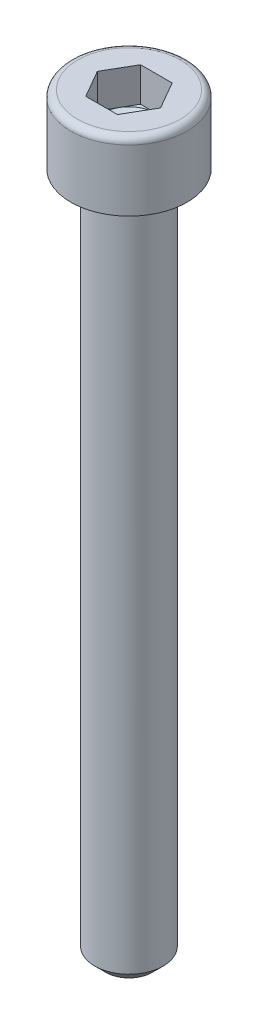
ISO-10303-21;
HEADER;
FILE_DESCRIPTION(('STEP AP214'),'2;1');
FILE_NAME('part.step','',(''),(''),'','','');
FILE_SCHEMA(('AUTOMOTIVE_DESIGN { 1 0 10303 214 1 1 1 1 }'));
ENDSEC;
DATA;
#1=APPLICATION_CONTEXT('core data for automotive mechanical design processes');
#2=APPLICATION_PROTOCOL_DEFINITION('international standard','automotive_design',2000,#1);
#3=PRODUCT_CONTEXT('',#1,'mechanical');
#4=PRODUCT('Part','Part','',(#3));
#5=PRODUCT_RELATED_PRODUCT_CATEGORY('part','',(#4));
#6=PRODUCT_DEFINITION_FORMATION('','',#4);
#7=PRODUCT_DEFINITION_CONTEXT('part definition',#1,'design');
#8=PRODUCT_DEFINITION('design','',#6,#7);
#9=PRODUCT_DEFINITION_SHAPE('','',#8);
#10=(LENGTH_UNIT() NAMED_UNIT(*) SI_UNIT(.MILLI.,.METRE.));
#11=(NAMED_UNIT(*) PLANE_ANGLE_UNIT() SI_UNIT($,.RADIAN.));
#12=(NAMED_UNIT(*) SI_UNIT($,.STERADIAN.) SOLID_ANGLE_UNIT());
#13=UNCERTAINTY_MEASURE_WITH_UNIT(LENGTH_MEASURE(1.E-05),#10,'distance_accuracy_value','');
#14=(GEOMETRIC_REPRESENTATION_CONTEXT(3) GLOBAL_UNCERTAINTY_ASSIGNED_CONTEXT((#13)) GLOBAL_UNIT_ASSIGNED_CONTEXT((#10,
#11,#12)) REPRESENTATION_CONTEXT('',''));
#15=CARTESIAN_POINT('',(0.,0.,0.));
#16=DIRECTION('',(0.,0.,1.));
#17=DIRECTION('',(1.,0.,0.));
#18=AXIS2_PLACEMENT_3D('',#15,#16,#17);
#19=CARTESIAN_POINT('',(-3.46410161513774,2.5,2.));
#20=DIRECTION('',(0.,-1.,0.));
#21=DIRECTION('',(0.,0.,-1.));
#22=AXIS2_PLACEMENT_3D('',#19,#20,#21);
#23=PLANE('',#22);
#24=DIRECTION('',(-0.499999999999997,0.,0.86602540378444));
#25=VECTOR('',#24,1.);
#26=CARTESIAN_POINT('',(1.73205080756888,2.5,0.999999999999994));
#27=LINE('',#26,#25);
#28=CARTESIAN_POINT('',(1.73205080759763,2.49999999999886,1.00000000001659));
#29=VERTEX_POINT('',#28);
#30=CARTESIAN_POINT('',(1.15470053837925,2.5,2.));
#31=VERTEX_POINT('',#30);
#32=EDGE_CURVE('E102',#29,#31,#27,.T.);
#33=ORIENTED_EDGE('',*,*,#32,.F.);
#34=CARTESIAN_POINT('',(0.,2.49999999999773,0.));
#35=DIRECTION('',(0.,1.,0.));
#36=DIRECTION('',(-1.,0.,0.));
#37=AXIS2_PLACEMENT_3D('',#34,#35,#36);
#38=CIRCLE('',#37,2.00000000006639);
#39=CARTESIAN_POINT('',(0.,2.49999999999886,2.0000000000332));
#40=VERTEX_POINT('',#39);
#41=EDGE_CURVE('E110',#29,#40,#38,.F.);
#42=ORIENTED_EDGE('',*,*,#41,.T.);
#43=DIRECTION('',(1.,0.,0.));
#44=VECTOR('',#43,1.);
#45=CARTESIAN_POINT('',(-3.46410161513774,2.5,2.));
#46=LINE('',#45,#44);
#47=EDGE_CURVE('E79',#31,#40,#46,.F.);
#48=ORIENTED_EDGE('',*,*,#47,.F.);
#49=EDGE_LOOP('',(#33,#42,#48));
#50=FACE_BOUND('',#49,.T.);
#51=ADVANCED_FACE('F16',(#50),#23,.F.);
#52=CARTESIAN_POINT('',(-3.46410161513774,2.5,2.));
#53=DIRECTION('',(0.,-1.,0.));
#54=DIRECTION('',(0.,0.,-1.));
#55=AXIS2_PLACEMENT_3D('',#52,#53,#54);
#56=PLANE('',#55);
#57=DIRECTION('',(1.,0.,0.));
#58=VECTOR('',#57,1.);
#59=CARTESIAN_POINT('',(-3.46410161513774,2.5,2.));
#60=LINE('',#59,#58);
#61=CARTESIAN_POINT('',(-1.15470053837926,2.5,2.));
#62=VERTEX_POINT('',#61);
#63=EDGE_CURVE('E261',#40,#62,#60,.F.);
#64=ORIENTED_EDGE('',*,*,#63,.F.);
#65=CARTESIAN_POINT('',(0.,2.49999999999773,0.));
#66=DIRECTION('',(0.,1.,0.));
#67=DIRECTION('',(-1.,0.,0.));
#68=AXIS2_PLACEMENT_3D('',#65,#66,#67);
#69=CIRCLE('',#68,2.00000000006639);
#70=CARTESIAN_POINT('',(-1.73205080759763,2.49999999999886,1.00000000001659));
#71=VERTEX_POINT('',#70);
#72=EDGE_CURVE('E116',#40,#71,#69,.F.);
#73=ORIENTED_EDGE('',*,*,#72,.T.);
#74=DIRECTION('',(-0.499999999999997,0.,-0.86602540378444));
#75=VECTOR('',#74,1.);
#76=CARTESIAN_POINT('',(-1.15470053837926,2.5,2.));
#77=LINE('',#76,#75);
#78=EDGE_CURVE('E259',#62,#71,#77,.T.);
#79=ORIENTED_EDGE('',*,*,#78,.F.);
#80=EDGE_LOOP('',(#64,#73,#79));
#81=FACE_BOUND('',#80,.T.);
#82=ADVANCED_FACE('F263',(#81),#56,.F.);
#83=CARTESIAN_POINT('',(-3.46410161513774,2.5,2.));
#84=DIRECTION('',(0.,-1.,0.));
#85=DIRECTION('',(0.,0.,-1.));
#86=AXIS2_PLACEMENT_3D('',#83,#84,#85);
#87=PLANE('',#86);
#88=DIRECTION('',(1.,0.,0.));
#89=VECTOR('',#88,1.);
#90=CARTESIAN_POINT('',(-3.46410161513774,2.5,-2.));
#91=LINE('',#90,#89);
#92=CARTESIAN_POINT('',(0.,2.49999999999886,-2.0000000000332));
#93=VERTEX_POINT('',#92);
#94=CARTESIAN_POINT('',(1.15470053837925,2.5,-2.));
#95=VERTEX_POINT('',#94);
#96=EDGE_CURVE('E121',#93,#95,#91,.T.);
#97=ORIENTED_EDGE('',*,*,#96,.F.);
#98=CARTESIAN_POINT('',(0.,2.49999999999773,0.));
#99=DIRECTION('',(0.,1.,0.));
#100=DIRECTION('',(-1.,0.,0.));
#101=AXIS2_PLACEMENT_3D('',#98,#99,#100);
#102=CIRCLE('',#101,2.00000000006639);
#103=CARTESIAN_POINT('',(1.73205080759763,2.49999999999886,-1.00000000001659));
#104=VERTEX_POINT('',#103);
#105=EDGE_CURVE('E96',#93,#104,#102,.F.);
#106=ORIENTED_EDGE('',*,*,#105,.T.);
#107=DIRECTION('',(0.499999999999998,0.,0.86602540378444));
#108=VECTOR('',#107,1.);
#109=CARTESIAN_POINT('',(1.15470053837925,2.5,-2.));
#110=LINE('',#109,#108);
#111=EDGE_CURVE('E117',#95,#104,#110,.T.);
#112=ORIENTED_EDGE('',*,*,#111,.F.);
#113=EDGE_LOOP('',(#97,#106,#112));
#114=FACE_BOUND('',#113,.T.);
#115=ADVANCED_FACE('F285',(#114),#87,.F.);
#116=CARTESIAN_POINT('',(0.,2.49999999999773,0.));
#117=DIRECTION('',(0.,1.,0.));
#118=DIRECTION('',(-1.,0.,0.));
#119=AXIS2_PLACEMENT_3D('',#116,#117,#118);
#120=CONICAL_SURFACE('',#119,2.00000000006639,1.04719755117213);
#121=CARTESIAN_POINT('',(-7.105427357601E-11,1.34529946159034,0.));
#122=VERTEX_POINT('',#121);
#123=VERTEX_LOOP('',#122);
#124=FACE_BOUND('',#123,.T.);
#125=ORIENTED_EDGE('',*,*,#41,.F.);
#126=CARTESIAN_POINT('',(0.,2.49999999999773,0.));
#127=DIRECTION('',(0.,1.,0.));
#128=DIRECTION('',(-1.,0.,0.));
#129=AXIS2_PLACEMENT_3D('',#126,#127,#128);
#130=CIRCLE('',#129,2.00000000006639);
#131=EDGE_CURVE('E85',#104,#29,#130,.F.);
#132=ORIENTED_EDGE('',*,*,#131,.F.);
#133=ORIENTED_EDGE('',*,*,#105,.F.);
#134=CARTESIAN_POINT('',(0.,2.49999999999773,0.));
#135=DIRECTION('',(0.,1.,0.));
#136=DIRECTION('',(-1.,0.,0.));
#137=AXIS2_PLACEMENT_3D('',#134,#135,#136);
#138=CIRCLE('',#137,2.00000000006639);
#139=CARTESIAN_POINT('',(-1.73205080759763,2.49999999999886,-1.00000000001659));
#140=VERTEX_POINT('',#139);
#141=EDGE_CURVE('E95',#93,#140,#138,.T.);
#142=ORIENTED_EDGE('',*,*,#141,.T.);
#143=CARTESIAN_POINT('',(0.,2.49999999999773,0.));
#144=DIRECTION('',(0.,1.,0.));
#145=DIRECTION('',(-1.,0.,0.));
#146=AXIS2_PLACEMENT_3D('',#143,#144,#145);
#147=CIRCLE('',#146,2.00000000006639);
#148=EDGE_CURVE('E119',#71,#140,#147,.F.);
#149=ORIENTED_EDGE('',*,*,#148,.F.);
#150=ORIENTED_EDGE('',*,*,#72,.F.);
#151=EDGE_LOOP('',(#125,#132,#133,#142,#149,#150));
#152=FACE_BOUND('',#151,.T.);
#153=ADVANCED_FACE('F114',(#124,#152),#120,.F.);
#154=CARTESIAN_POINT('',(-3.46410161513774,2.5,2.));
#155=DIRECTION('',(0.,-1.,0.));
#156=DIRECTION('',(0.,0.,-1.));
#157=AXIS2_PLACEMENT_3D('',#154,#155,#156);
#158=PLANE('',#157);
#159=DIRECTION('',(0.499999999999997,0.,-0.86602540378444));
#160=VECTOR('',#159,1.);
#161=CARTESIAN_POINT('',(-1.15470053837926,2.5,-2.));
#162=LINE('',#161,#160);
#163=CARTESIAN_POINT('',(-1.15470053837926,2.5,-2.));
#164=VERTEX_POINT('',#163);
#165=EDGE_CURVE('E203',#140,#164,#162,.T.);
#166=ORIENTED_EDGE('',*,*,#165,.F.);
#167=ORIENTED_EDGE('',*,*,#141,.F.);
#168=DIRECTION('',(1.,0.,0.));
#169=VECTOR('',#168,1.);
#170=CARTESIAN_POINT('',(1.15470053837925,2.5,-2.));
#171=LINE('',#170,#169);
#172=EDGE_CURVE('E204',#164,#93,#171,.T.);
#173=ORIENTED_EDGE('',*,*,#172,.F.);
#174=EDGE_LOOP('',(#166,#167,#173));
#175=FACE_BOUND('',#174,.T.);
#176=ADVANCED_FACE('F245',(#175),#158,.F.);
#177=CARTESIAN_POINT('',(-3.46410161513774,2.5,2.));
#178=DIRECTION('',(0.,-1.,0.));
#179=DIRECTION('',(0.,0.,-1.));
#180=AXIS2_PLACEMENT_3D('',#177,#178,#179);
#181=PLANE('',#180);
#182=DIRECTION('',(-0.499999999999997,0.,-0.86602540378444));
#183=VECTOR('',#182,1.);
#184=CARTESIAN_POINT('',(-1.15470053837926,2.5,2.));
#185=LINE('',#184,#183);
#186=CARTESIAN_POINT('',(-2.3094010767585,2.5,0.));
#187=VERTEX_POINT('',#186);
#188=EDGE_CURVE('E189',#71,#187,#185,.T.);
#189=ORIENTED_EDGE('',*,*,#188,.F.);
#190=ORIENTED_EDGE('',*,*,#148,.T.);
#191=DIRECTION('',(0.499999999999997,0.,-0.86602540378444));
#192=VECTOR('',#191,1.);
#193=CARTESIAN_POINT('',(-1.15470053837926,2.5,-2.));
#194=LINE('',#193,#192);
#195=EDGE_CURVE('E200',#187,#140,#194,.T.);
#196=ORIENTED_EDGE('',*,*,#195,.F.);
#197=EDGE_LOOP('',(#189,#190,#196));
#198=FACE_BOUND('',#197,.T.);
#199=ADVANCED_FACE('F239',(#198),#181,.F.);
#200=CARTESIAN_POINT('',(-3.46410161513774,2.5,2.));
#201=DIRECTION('',(0.,-1.,0.));
#202=DIRECTION('',(0.,0.,-1.));
#203=AXIS2_PLACEMENT_3D('',#200,#201,#202);
#204=PLANE('',#203);
#205=DIRECTION('',(0.499999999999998,0.,0.86602540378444));
#206=VECTOR('',#205,1.);
#207=CARTESIAN_POINT('',(1.15470053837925,2.5,-2.));
#208=LINE('',#207,#206);
#209=CARTESIAN_POINT('',(2.3094010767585,2.5,0.));
#210=VERTEX_POINT('',#209);
#211=EDGE_CURVE('E91',#104,#210,#208,.T.);
#212=ORIENTED_EDGE('',*,*,#211,.F.);
#213=ORIENTED_EDGE('',*,*,#131,.T.);
#214=DIRECTION('',(-0.499999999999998,0.,0.86602540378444));
#215=VECTOR('',#214,1.);
#216=CARTESIAN_POINT('',(1.15470053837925,2.5,2.));
#217=LINE('',#216,#215);
#218=EDGE_CURVE('E88',#210,#29,#217,.T.);
#219=ORIENTED_EDGE('',*,*,#218,.F.);
#220=EDGE_LOOP('',(#212,#213,#219));
#221=FACE_BOUND('',#220,.T.);
#222=ADVANCED_FACE('F87',(#221),#204,.F.);
#223=CARTESIAN_POINT('',(1.15470053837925,2.5,-2.));
#224=DIRECTION('',(0.,0.,1.));
#225=DIRECTION('',(1.,0.,0.));
#226=AXIS2_PLACEMENT_3D('',#223,#224,#225);
#227=PLANE('',#226);
#228=ORIENTED_EDGE('',*,*,#96,.T.);
#229=DIRECTION('',(0.,1.,0.));
#230=VECTOR('',#229,1.);
#231=CARTESIAN_POINT('',(1.15470053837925,2.5,-2.));
#232=LINE('',#231,#230);
#233=CARTESIAN_POINT('',(1.15470053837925,5.,-2.));
#234=VERTEX_POINT('',#233);
#235=EDGE_CURVE('E181',#234,#95,#232,.F.);
#236=ORIENTED_EDGE('',*,*,#235,.F.);
#237=DIRECTION('',(1.,0.,0.));
#238=VECTOR('',#237,1.);
#239=CARTESIAN_POINT('',(2.,5.,-2.));
#240=LINE('',#239,#238);
#241=CARTESIAN_POINT('',(-1.15470053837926,5.,-2.));
#242=VERTEX_POINT('',#241);
#243=EDGE_CURVE('E165',#234,#242,#240,.F.);
#244=ORIENTED_EDGE('',*,*,#243,.T.);
#245=DIRECTION('',(0.,1.,0.));
#246=VECTOR('',#245,1.);
#247=CARTESIAN_POINT('',(-1.15470053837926,2.5,-2.));
#248=LINE('',#247,#246);
#249=EDGE_CURVE('E193',#164,#242,#248,.T.);
#250=ORIENTED_EDGE('',*,*,#249,.F.);
#251=ORIENTED_EDGE('',*,*,#172,.T.);
#252=EDGE_LOOP('',(#228,#236,#244,#250,#251));
#253=FACE_BOUND('',#252,.T.);
#254=ADVANCED_FACE('F277',(#253),#227,.T.);
#255=CARTESIAN_POINT('',(-1.15470053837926,2.5,-2.));
#256=DIRECTION('',(0.86602540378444,0.,0.499999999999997));
#257=DIRECTION('',(0.499999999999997,0.,-0.86602540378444));
#258=AXIS2_PLACEMENT_3D('',#255,#256,#257);
#259=PLANE('',#258);
#260=ORIENTED_EDGE('',*,*,#165,.T.);
#261=ORIENTED_EDGE('',*,*,#249,.T.);
#262=DIRECTION('',(-0.499999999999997,0.,0.86602540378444));
#263=VECTOR('',#262,1.);
#264=CARTESIAN_POINT('',(-1.15470053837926,5.,-2.));
#265=LINE('',#264,#263);
#266=CARTESIAN_POINT('',(-2.3094010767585,5.,0.));
#267=VERTEX_POINT('',#266);
#268=EDGE_CURVE('E252',#242,#267,#265,.T.);
#269=ORIENTED_EDGE('',*,*,#268,.T.);
#270=DIRECTION('',(0.,1.,0.));
#271=VECTOR('',#270,1.);
#272=CARTESIAN_POINT('',(-2.3094010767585,2.5,0.));
#273=LINE('',#272,#271);
#274=EDGE_CURVE('E192',#187,#267,#273,.T.);
#275=ORIENTED_EDGE('',*,*,#274,.F.);
#276=ORIENTED_EDGE('',*,*,#195,.T.);
#277=EDGE_LOOP('',(#260,#261,#269,#275,#276));
#278=FACE_BOUND('',#277,.T.);
#279=ADVANCED_FACE('F248',(#278),#259,.T.);
#280=CARTESIAN_POINT('',(-1.15470053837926,2.5,2.));
#281=DIRECTION('',(0.86602540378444,0.,-0.499999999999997));
#282=DIRECTION('',(-0.499999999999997,0.,-0.86602540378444));
#283=AXIS2_PLACEMENT_3D('',#280,#281,#282);
#284=PLANE('',#283);
#285=ORIENTED_EDGE('',*,*,#188,.T.);
#286=ORIENTED_EDGE('',*,*,#274,.T.);
#287=DIRECTION('',(0.499999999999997,0.,0.86602540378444));
#288=VECTOR('',#287,1.);
#289=CARTESIAN_POINT('',(-2.3094010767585,5.,0.));
#290=LINE('',#289,#288);
#291=CARTESIAN_POINT('',(-1.15470053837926,5.,2.));
#292=VERTEX_POINT('',#291);
#293=EDGE_CURVE('E434',#267,#292,#290,.T.);
#294=ORIENTED_EDGE('',*,*,#293,.T.);
#295=DIRECTION('',(0.,1.,0.));
#296=VECTOR('',#295,1.);
#297=CARTESIAN_POINT('',(-1.15470053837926,2.5,2.));
#298=LINE('',#297,#296);
#299=EDGE_CURVE('E107',#62,#292,#298,.T.);
#300=ORIENTED_EDGE('',*,*,#299,.F.);
#301=ORIENTED_EDGE('',*,*,#78,.T.);
#302=EDGE_LOOP('',(#285,#286,#294,#300,#301));
#303=FACE_BOUND('',#302,.T.);
#304=ADVANCED_FACE('F256',(#303),#284,.T.);
#305=CARTESIAN_POINT('',(1.15470053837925,2.5,2.));
#306=DIRECTION('',(0.,0.,-1.));
#307=DIRECTION('',(-1.,0.,0.));
#308=AXIS2_PLACEMENT_3D('',#305,#306,#307);
#309=PLANE('',#308);
#310=ORIENTED_EDGE('',*,*,#63,.T.);
#311=ORIENTED_EDGE('',*,*,#299,.T.);
#312=DIRECTION('',(1.,0.,0.));
#313=VECTOR('',#312,1.);
#314=CARTESIAN_POINT('',(2.,5.,2.));
#315=LINE('',#314,#313);
#316=CARTESIAN_POINT('',(1.15470053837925,5.,2.));
#317=VERTEX_POINT('',#316);
#318=EDGE_CURVE('E435',#292,#317,#315,.T.);
#319=ORIENTED_EDGE('',*,*,#318,.T.);
#320=DIRECTION('',(0.,1.,0.));
#321=VECTOR('',#320,1.);
#322=CARTESIAN_POINT('',(1.15470053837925,2.5,2.));
#323=LINE('',#322,#321);
#324=EDGE_CURVE('E106',#31,#317,#323,.T.);
#325=ORIENTED_EDGE('',*,*,#324,.F.);
#326=ORIENTED_EDGE('',*,*,#47,.T.);
#327=EDGE_LOOP('',(#310,#311,#319,#325,#326));
#328=FACE_BOUND('',#327,.T.);
#329=ADVANCED_FACE('F362',(#328),#309,.T.);
#330=CARTESIAN_POINT('',(1.15470053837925,2.5,2.));
#331=DIRECTION('',(-0.86602540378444,0.,-0.499999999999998));
#332=DIRECTION('',(-0.499999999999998,0.,0.86602540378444));
#333=AXIS2_PLACEMENT_3D('',#330,#331,#332);
#334=PLANE('',#333);
#335=ORIENTED_EDGE('',*,*,#32,.T.);
#336=ORIENTED_EDGE('',*,*,#324,.T.);
#337=DIRECTION('',(0.499999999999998,0.,-0.86602540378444));
#338=VECTOR('',#337,1.);
#339=CARTESIAN_POINT('',(1.15470053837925,5.,2.));
#340=LINE('',#339,#338);
#341=CARTESIAN_POINT('',(2.3094010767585,5.,0.));
#342=VERTEX_POINT('',#341);
#343=EDGE_CURVE('E438',#317,#342,#340,.T.);
#344=ORIENTED_EDGE('',*,*,#343,.T.);
#345=DIRECTION('',(0.,1.,0.));
#346=VECTOR('',#345,1.);
#347=CARTESIAN_POINT('',(2.3094010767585,2.5,0.));
#348=LINE('',#347,#346);
#349=EDGE_CURVE('E105',#210,#342,#348,.T.);
#350=ORIENTED_EDGE('',*,*,#349,.F.);
#351=ORIENTED_EDGE('',*,*,#218,.T.);
#352=EDGE_LOOP('',(#335,#336,#344,#350,#351));
#353=FACE_BOUND('',#352,.T.);
#354=ADVANCED_FACE('F100',(#353),#334,.T.);
#355=CARTESIAN_POINT('',(1.15470053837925,2.5,-2.));
#356=DIRECTION('',(-0.86602540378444,0.,0.499999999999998));
#357=DIRECTION('',(0.499999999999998,0.,0.86602540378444));
#358=AXIS2_PLACEMENT_3D('',#355,#356,#357);
#359=PLANE('',#358);
#360=ORIENTED_EDGE('',*,*,#211,.T.);
#361=ORIENTED_EDGE('',*,*,#349,.T.);
#362=DIRECTION('',(-0.499999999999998,0.,-0.86602540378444));
#363=VECTOR('',#362,1.);
#364=CARTESIAN_POINT('',(2.3094010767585,5.,0.));
#365=LINE('',#364,#363);
#366=EDGE_CURVE('E129',#342,#234,#365,.T.);
#367=ORIENTED_EDGE('',*,*,#366,.T.);
#368=ORIENTED_EDGE('',*,*,#235,.T.);
#369=ORIENTED_EDGE('',*,*,#111,.T.);
#370=EDGE_LOOP('',(#360,#361,#367,#368,#369));
#371=FACE_BOUND('',#370,.T.);
#372=ADVANCED_FACE('F150',(#371),#359,.T.);
#373=CARTESIAN_POINT('',(2.,5.,0.));
#374=DIRECTION('',(0.,-1.,0.));
#375=DIRECTION('',(1.,0.,0.));
#376=AXIS2_PLACEMENT_3D('',#373,#374,#375);
#377=PLANE('',#376);
#378=ORIENTED_EDGE('',*,*,#343,.F.);
#379=ORIENTED_EDGE('',*,*,#318,.F.);
#380=ORIENTED_EDGE('',*,*,#293,.F.);
#381=ORIENTED_EDGE('',*,*,#268,.F.);
#382=ORIENTED_EDGE('',*,*,#243,.F.);
#383=ORIENTED_EDGE('',*,*,#366,.F.);
#384=EDGE_LOOP('',(#378,#379,#380,#381,#382,#383));
#385=FACE_BOUND('',#384,.T.);
#386=CARTESIAN_POINT('',(0.,5.,0.));
#387=DIRECTION('',(0.,-1.,0.));
#388=DIRECTION('',(-1.,0.,0.));
#389=AXIS2_PLACEMENT_3D('',#386,#387,#388);
#390=CIRCLE('',#389,3.75);
#391=CARTESIAN_POINT('',(-3.75,5.,0.));
#392=VERTEX_POINT('',#391);
#393=CARTESIAN_POINT('',(3.75,5.,0.));
#394=VERTEX_POINT('',#393);
#395=EDGE_CURVE('E36',#392,#394,#390,.T.);
#396=ORIENTED_EDGE('',*,*,#395,.F.);
#397=CARTESIAN_POINT('',(0.,5.,0.));
#398=DIRECTION('',(0.,-1.,0.));
#399=DIRECTION('',(1.,0.,0.));
#400=AXIS2_PLACEMENT_3D('',#397,#398,#399);
#401=CIRCLE('',#400,3.75);
#402=EDGE_CURVE('E127',#394,#392,#401,.T.);
#403=ORIENTED_EDGE('',*,*,#402,.F.);
#404=EDGE_LOOP('',(#396,#403));
#405=FACE_BOUND('',#404,.T.);
#406=ADVANCED_FACE('F131',(#385,#405),#377,.F.);
#407=CARTESIAN_POINT('',(0.,4.5,0.));
#408=DIRECTION('',(0.,1.,0.));
#409=DIRECTION('',(-1.,0.,0.));
#410=AXIS2_PLACEMENT_3D('',#407,#408,#409);
#411=TOROIDAL_SURFACE('',#410,3.75,0.5);
#412=ORIENTED_EDGE('',*,*,#395,.T.);
#413=ORIENTED_EDGE('',*,*,#402,.T.);
#414=EDGE_LOOP('',(#412,#413));
#415=FACE_BOUND('',#414,.T.);
#416=CARTESIAN_POINT('',(0.,4.5,0.));
#417=DIRECTION('',(0.,1.,0.));
#418=DIRECTION('',(-1.,0.,0.));
#419=AXIS2_PLACEMENT_3D('',#416,#417,#418);
#420=CIRCLE('',#419,4.25);
#421=CARTESIAN_POINT('',(-4.25,4.5,0.));
#422=VERTEX_POINT('',#421);
#423=EDGE_CURVE('E132',#422,#422,#420,.F.);
#424=ORIENTED_EDGE('',*,*,#423,.F.);
#425=EDGE_LOOP('',(#424));
#426=FACE_BOUND('',#425,.T.);
#427=ADVANCED_FACE('F125',(#415,#426),#411,.T.);
#428=CARTESIAN_POINT('',(0.,-50.,0.));
#429=DIRECTION('',(0.,1.,0.));
#430=DIRECTION('',(0.,0.,1.));
#431=AXIS2_PLACEMENT_3D('',#428,#429,#430);
#432=PLANE('',#431);
#433=CARTESIAN_POINT('',(0.,-50.0000000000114,0.));
#434=DIRECTION('',(0.,1.,0.));
#435=DIRECTION('',(-1.,0.,0.));
#436=AXIS2_PLACEMENT_3D('',#433,#434,#435);
#437=CIRCLE('',#436,1.69999999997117);
#438=CARTESIAN_POINT('',(-1.69999999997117,-50.0000000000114,0.));
#439=VERTEX_POINT('',#438);
#440=EDGE_CURVE('E171',#439,#439,#437,.T.);
#441=ORIENTED_EDGE('',*,*,#440,.F.);
#442=EDGE_LOOP('',(#441));
#443=FACE_BOUND('',#442,.T.);
#444=ADVANCED_FACE('F158',(#443),#432,.F.);
#445=CARTESIAN_POINT('',(0.,5.,0.));
#446=DIRECTION('',(0.,1.,0.));
#447=DIRECTION('',(-1.,0.,0.));
#448=AXIS2_PLACEMENT_3D('',#445,#446,#447);
#449=CYLINDRICAL_SURFACE('',#448,4.25);
#450=ORIENTED_EDGE('',*,*,#423,.T.);
#451=EDGE_LOOP('',(#450));
#452=FACE_BOUND('',#451,.T.);
#453=CARTESIAN_POINT('',(0.,0.,0.));
#454=DIRECTION('',(0.,1.,0.));
#455=DIRECTION('',(-1.,0.,0.));
#456=AXIS2_PLACEMENT_3D('',#453,#454,#455);
#457=CIRCLE('',#456,4.25);
#458=CARTESIAN_POINT('',(-4.25,0.,0.));
#459=VERTEX_POINT('',#458);
#460=EDGE_CURVE('E169',#459,#459,#457,.T.);
#461=ORIENTED_EDGE('',*,*,#460,.T.);
#462=EDGE_LOOP('',(#461));
#463=FACE_BOUND('',#462,.T.);
#464=ADVANCED_FACE('F310',(#452,#463),#449,.T.);
#465=CARTESIAN_POINT('',(0.,-49.2000000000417,0.));
#466=DIRECTION('',(0.,1.,0.));
#467=DIRECTION('',(-1.,0.,0.));
#468=AXIS2_PLACEMENT_3D('',#465,#466,#467);
#469=CONICAL_SURFACE('',#468,2.49999999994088,0.785398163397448);
#470=CARTESIAN_POINT('',(0.,-49.2,0.));
#471=DIRECTION('',(0.,1.,0.));
#472=DIRECTION('',(0.,0.,1.));
#473=AXIS2_PLACEMENT_3D('',#470,#471,#472);
#474=CIRCLE('',#473,2.5);
#475=CARTESIAN_POINT('',(0.,-49.2,2.5));
#476=VERTEX_POINT('',#475);
#477=EDGE_CURVE('E28',#476,#476,#474,.T.);
#478=ORIENTED_EDGE('',*,*,#477,.F.);
#479=EDGE_LOOP('',(#478));
#480=FACE_BOUND('',#479,.T.);
#481=ORIENTED_EDGE('',*,*,#440,.T.);
#482=EDGE_LOOP('',(#481));
#483=FACE_BOUND('',#482,.T.);
#484=ADVANCED_FACE('F302',(#480,#483),#469,.T.);
#485=CARTESIAN_POINT('',(0.,0.,0.));
#486=DIRECTION('',(0.,1.,0.));
#487=DIRECTION('',(-1.,0.,0.));
#488=AXIS2_PLACEMENT_3D('',#485,#486,#487);
#489=PLANE('',#488);
#490=ORIENTED_EDGE('',*,*,#460,.F.);
#491=EDGE_LOOP('',(#490));
#492=FACE_BOUND('',#491,.T.);
#493=CARTESIAN_POINT('',(0.,0.,0.));
#494=DIRECTION('',(0.,1.,0.));
#495=DIRECTION('',(0.,0.,1.));
#496=AXIS2_PLACEMENT_3D('',#493,#494,#495);
#497=CIRCLE('',#496,2.5);
#498=CARTESIAN_POINT('',(0.,0.,2.5));
#499=VERTEX_POINT('',#498);
#500=EDGE_CURVE('E10',#499,#499,#497,.F.);
#501=ORIENTED_EDGE('',*,*,#500,.F.);
#502=EDGE_LOOP('',(#501));
#503=FACE_BOUND('',#502,.T.);
#504=ADVANCED_FACE('F297',(#492,#503),#489,.F.);
#505=CARTESIAN_POINT('',(0.,-50.,0.));
#506=DIRECTION('',(0.,1.,0.));
#507=DIRECTION('',(0.,0.,1.));
#508=AXIS2_PLACEMENT_3D('',#505,#506,#507);
#509=CYLINDRICAL_SURFACE('',#508,2.5);
#510=ORIENTED_EDGE('',*,*,#500,.T.);
#511=EDGE_LOOP('',(#510));
#512=FACE_BOUND('',#511,.T.);
#513=ORIENTED_EDGE('',*,*,#477,.T.);
#514=EDGE_LOOP('',(#513));
#515=FACE_BOUND('',#514,.T.);
#516=ADVANCED_FACE('F18',(#512,#515),#509,.T.);
#517=CLOSED_SHELL('',(#51,#82,#115,#153,#176,#199,#222,#254,#279,#304,#329,#354,#372,#406,#427,
#444,#464,#484,#504,#516));
#518=MANIFOLD_SOLID_BREP('B1',#517);
#519=ADVANCED_BREP_SHAPE_REPRESENTATION('',(#18,#518),#14);
#520=SHAPE_DEFINITION_REPRESENTATION(#9,#519);
ENDSEC;
END-ISO-10303-21;
